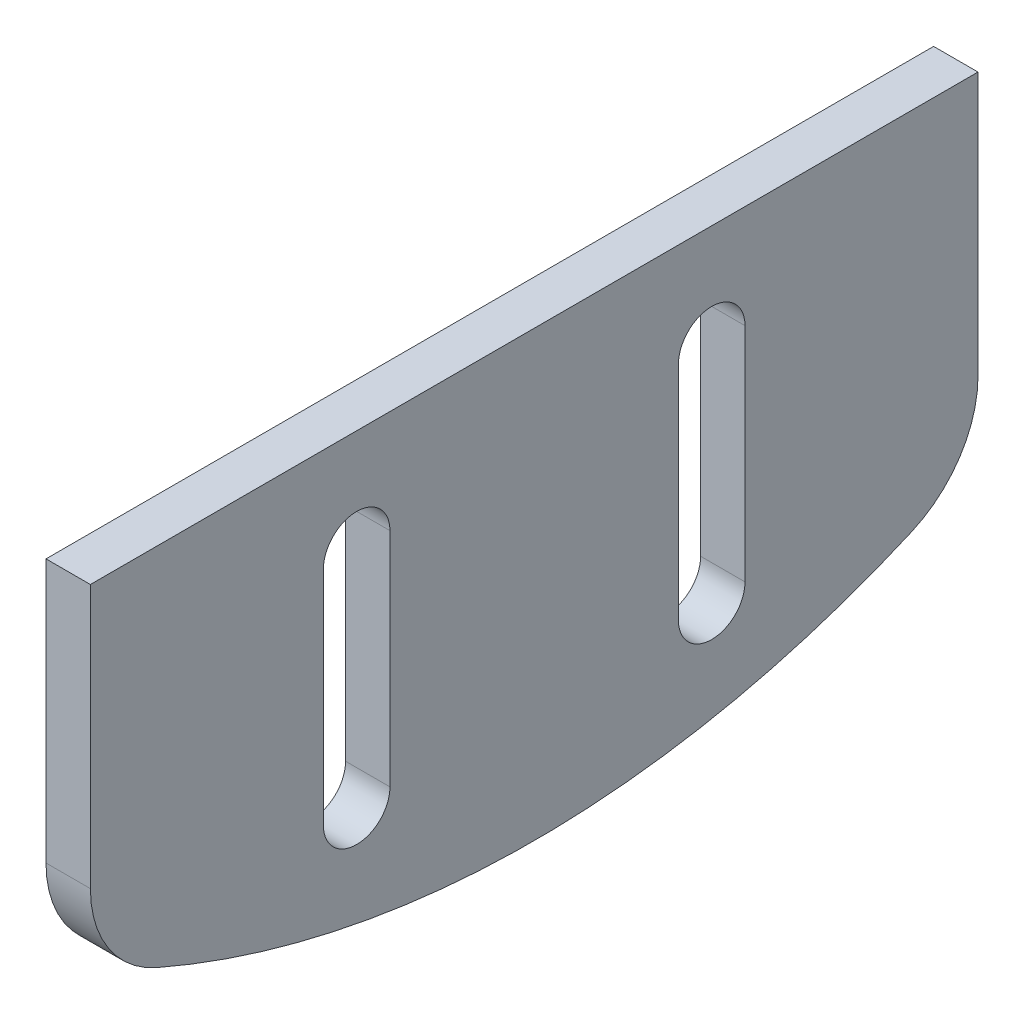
ISO-10303-21;
HEADER;
FILE_DESCRIPTION(('STEP AP214'),'2;1');
FILE_NAME('part.step','',(''),(''),'','','');
FILE_SCHEMA(('AUTOMOTIVE_DESIGN { 1 0 10303 214 1 1 1 1 }'));
ENDSEC;
DATA;
#1=APPLICATION_CONTEXT('core data for automotive mechanical design processes');
#2=APPLICATION_PROTOCOL_DEFINITION('international standard','automotive_design',2000,#1);
#3=PRODUCT_CONTEXT('',#1,'mechanical');
#4=PRODUCT('Part','Part','',(#3));
#5=PRODUCT_RELATED_PRODUCT_CATEGORY('part','',(#4));
#6=PRODUCT_DEFINITION_FORMATION('','',#4);
#7=PRODUCT_DEFINITION_CONTEXT('part definition',#1,'design');
#8=PRODUCT_DEFINITION('design','',#6,#7);
#9=PRODUCT_DEFINITION_SHAPE('','',#8);
#10=(LENGTH_UNIT() NAMED_UNIT(*) SI_UNIT(.MILLI.,.METRE.));
#11=(NAMED_UNIT(*) PLANE_ANGLE_UNIT() SI_UNIT($,.RADIAN.));
#12=(NAMED_UNIT(*) SI_UNIT($,.STERADIAN.) SOLID_ANGLE_UNIT());
#13=UNCERTAINTY_MEASURE_WITH_UNIT(LENGTH_MEASURE(1.E-05),#10,'distance_accuracy_value','');
#14=(GEOMETRIC_REPRESENTATION_CONTEXT(3) GLOBAL_UNCERTAINTY_ASSIGNED_CONTEXT((#13)) GLOBAL_UNIT_ASSIGNED_CONTEXT((#10,
#11,#12)) REPRESENTATION_CONTEXT('',''));
#15=CARTESIAN_POINT('',(0.,0.,0.));
#16=DIRECTION('',(0.,0.,1.));
#17=DIRECTION('',(1.,0.,0.));
#18=AXIS2_PLACEMENT_3D('',#15,#16,#17);
#19=CARTESIAN_POINT('',(2.,5.,-20.));
#20=DIRECTION('',(0.,0.,1.));
#21=DIRECTION('',(1.,0.,0.));
#22=AXIS2_PLACEMENT_3D('',#19,#20,#21);
#23=PLANE('',#22);
#24=DIRECTION('',(0.,1.,0.));
#25=VECTOR('',#24,1.);
#26=CARTESIAN_POINT('',(2.,5.,-20.));
#27=LINE('',#26,#25);
#28=CARTESIAN_POINT('',(2.,8.1306822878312,-20.));
#29=VERTEX_POINT('',#28);
#30=CARTESIAN_POINT('',(2.,20.,-20.));
#31=VERTEX_POINT('',#30);
#32=EDGE_CURVE('E219',#29,#31,#27,.T.);
#33=ORIENTED_EDGE('',*,*,#32,.F.);
#34=DIRECTION('',(-1.,0.,0.));
#35=VECTOR('',#34,1.);
#36=CARTESIAN_POINT('',(2.,8.1306822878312,-20.));
#37=LINE('',#36,#35);
#38=CARTESIAN_POINT('',(0.,8.1306822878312,-20.));
#39=VERTEX_POINT('',#38);
#40=EDGE_CURVE('E11',#29,#39,#37,.T.);
#41=ORIENTED_EDGE('',*,*,#40,.T.);
#42=DIRECTION('',(0.,1.,0.));
#43=VECTOR('',#42,1.);
#44=CARTESIAN_POINT('',(0.,5.,-20.));
#45=LINE('',#44,#43);
#46=CARTESIAN_POINT('',(0.,20.,-20.));
#47=VERTEX_POINT('',#46);
#48=EDGE_CURVE('E184',#39,#47,#45,.T.);
#49=ORIENTED_EDGE('',*,*,#48,.T.);
#50=DIRECTION('',(-1.,0.,0.));
#51=VECTOR('',#50,1.);
#52=CARTESIAN_POINT('',(2.,20.,-20.));
#53=LINE('',#52,#51);
#54=EDGE_CURVE('E238',#31,#47,#53,.T.);
#55=ORIENTED_EDGE('',*,*,#54,.F.);
#56=EDGE_LOOP('',(#33,#41,#49,#55));
#57=FACE_BOUND('',#56,.T.);
#58=ADVANCED_FACE('F39',(#57),#23,.F.);
#59=CARTESIAN_POINT('',(2.,20.,20.));
#60=DIRECTION('',(0.,-1.,0.));
#61=DIRECTION('',(0.,0.,-1.));
#62=AXIS2_PLACEMENT_3D('',#59,#60,#61);
#63=PLANE('',#62);
#64=DIRECTION('',(0.,0.,1.));
#65=VECTOR('',#64,1.);
#66=CARTESIAN_POINT('',(0.,20.,20.));
#67=LINE('',#66,#65);
#68=CARTESIAN_POINT('',(0.,20.,20.));
#69=VERTEX_POINT('',#68);
#70=EDGE_CURVE('E230',#47,#69,#67,.T.);
#71=ORIENTED_EDGE('',*,*,#70,.T.);
#72=DIRECTION('',(-1.,0.,0.));
#73=VECTOR('',#72,1.);
#74=CARTESIAN_POINT('',(2.,20.,20.));
#75=LINE('',#74,#73);
#76=CARTESIAN_POINT('',(2.,20.,20.));
#77=VERTEX_POINT('',#76);
#78=EDGE_CURVE('E228',#77,#69,#75,.T.);
#79=ORIENTED_EDGE('',*,*,#78,.F.);
#80=DIRECTION('',(0.,0.,1.));
#81=VECTOR('',#80,1.);
#82=CARTESIAN_POINT('',(2.,20.,20.));
#83=LINE('',#82,#81);
#84=EDGE_CURVE('E221',#31,#77,#83,.T.);
#85=ORIENTED_EDGE('',*,*,#84,.F.);
#86=ORIENTED_EDGE('',*,*,#54,.T.);
#87=EDGE_LOOP('',(#71,#79,#85,#86));
#88=FACE_BOUND('',#87,.T.);
#89=ADVANCED_FACE('F268',(#88),#63,.F.);
#90=CARTESIAN_POINT('',(2.,5.,20.));
#91=DIRECTION('',(0.,0.,-1.));
#92=DIRECTION('',(-1.,0.,0.));
#93=AXIS2_PLACEMENT_3D('',#90,#91,#92);
#94=PLANE('',#93);
#95=DIRECTION('',(0.,-1.,0.));
#96=VECTOR('',#95,1.);
#97=CARTESIAN_POINT('',(0.,5.,20.));
#98=LINE('',#97,#96);
#99=CARTESIAN_POINT('',(0.,8.1306822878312,20.));
#100=VERTEX_POINT('',#99);
#101=EDGE_CURVE('E232',#69,#100,#98,.T.);
#102=ORIENTED_EDGE('',*,*,#101,.T.);
#103=DIRECTION('',(-1.,0.,0.));
#104=VECTOR('',#103,1.);
#105=CARTESIAN_POINT('',(2.,8.1306822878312,20.));
#106=LINE('',#105,#104);
#107=CARTESIAN_POINT('',(2.,8.1306822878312,20.));
#108=VERTEX_POINT('',#107);
#109=EDGE_CURVE('E62',#100,#108,#106,.F.);
#110=ORIENTED_EDGE('',*,*,#109,.T.);
#111=DIRECTION('',(0.,-1.,0.));
#112=VECTOR('',#111,1.);
#113=CARTESIAN_POINT('',(2.,5.,20.));
#114=LINE('',#113,#112);
#115=EDGE_CURVE('E224',#77,#108,#114,.T.);
#116=ORIENTED_EDGE('',*,*,#115,.F.);
#117=ORIENTED_EDGE('',*,*,#78,.T.);
#118=EDGE_LOOP('',(#102,#110,#116,#117));
#119=FACE_BOUND('',#118,.T.);
#120=ADVANCED_FACE('F264',(#119),#94,.F.);
#121=CARTESIAN_POINT('',(2.,42.5,0.));
#122=DIRECTION('',(-1.,0.,0.));
#123=DIRECTION('',(0.,0.,1.));
#124=AXIS2_PLACEMENT_3D('',#121,#122,#123);
#125=CYLINDRICAL_SURFACE('',#124,42.5);
#126=CARTESIAN_POINT('',(2.,42.5,0.));
#127=DIRECTION('',(1.,0.,0.));
#128=DIRECTION('',(0.,0.,-1.));
#129=AXIS2_PLACEMENT_3D('',#126,#127,#128);
#130=CIRCLE('',#129,42.5);
#131=CARTESIAN_POINT('',(2.,3.54810659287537,17.));
#132=VERTEX_POINT('',#131);
#133=CARTESIAN_POINT('',(2.,3.54810659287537,-17.));
#134=VERTEX_POINT('',#133);
#135=EDGE_CURVE('E226',#132,#134,#130,.T.);
#136=ORIENTED_EDGE('',*,*,#135,.F.);
#137=DIRECTION('',(-1.,0.,0.));
#138=VECTOR('',#137,1.);
#139=CARTESIAN_POINT('',(2.,3.54810659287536,17.));
#140=LINE('',#139,#138);
#141=CARTESIAN_POINT('',(0.,3.54810659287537,17.));
#142=VERTEX_POINT('',#141);
#143=EDGE_CURVE('E243',#132,#142,#140,.T.);
#144=ORIENTED_EDGE('',*,*,#143,.T.);
#145=CARTESIAN_POINT('',(0.,42.5,0.));
#146=DIRECTION('',(1.,0.,0.));
#147=DIRECTION('',(0.,0.,-1.));
#148=AXIS2_PLACEMENT_3D('',#145,#146,#147);
#149=CIRCLE('',#148,42.5);
#150=CARTESIAN_POINT('',(0.,3.54810659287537,-17.));
#151=VERTEX_POINT('',#150);
#152=EDGE_CURVE('E222',#142,#151,#149,.T.);
#153=ORIENTED_EDGE('',*,*,#152,.T.);
#154=DIRECTION('',(-1.,0.,0.));
#155=VECTOR('',#154,1.);
#156=CARTESIAN_POINT('',(2.,3.54810659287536,-17.));
#157=LINE('',#156,#155);
#158=EDGE_CURVE('E241',#151,#134,#157,.F.);
#159=ORIENTED_EDGE('',*,*,#158,.T.);
#160=EDGE_LOOP('',(#136,#144,#153,#159));
#161=FACE_BOUND('',#160,.T.);
#162=ADVANCED_FACE('F257',(#161),#125,.T.);
#163=CARTESIAN_POINT('',(2.,42.5,0.));
#164=DIRECTION('',(1.,0.,0.));
#165=DIRECTION('',(0.,0.,-1.));
#166=AXIS2_PLACEMENT_3D('',#163,#164,#165);
#167=PLANE('',#166);
#168=CARTESIAN_POINT('',(2.,5.35164875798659,8.));
#169=DIRECTION('',(1.,0.,0.));
#170=DIRECTION('',(0.,0.,-1.));
#171=AXIS2_PLACEMENT_3D('',#168,#169,#170);
#172=CIRCLE('',#171,1.5);
#173=CARTESIAN_POINT('',(2.,5.35164875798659,9.5));
#174=VERTEX_POINT('',#173);
#175=CARTESIAN_POINT('',(2.,5.35164875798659,6.5));
#176=VERTEX_POINT('',#175);
#177=EDGE_CURVE('E150',#174,#176,#172,.T.);
#178=ORIENTED_EDGE('',*,*,#177,.F.);
#179=DIRECTION('',(0.,-1.,0.));
#180=VECTOR('',#179,1.);
#181=CARTESIAN_POINT('',(2.,5.35164875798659,9.5));
#182=LINE('',#181,#180);
#183=CARTESIAN_POINT('',(2.,15.3516487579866,9.5));
#184=VERTEX_POINT('',#183);
#185=EDGE_CURVE('E168',#184,#174,#182,.T.);
#186=ORIENTED_EDGE('',*,*,#185,.F.);
#187=CARTESIAN_POINT('',(2.,15.3516487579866,8.));
#188=DIRECTION('',(1.,0.,0.));
#189=DIRECTION('',(0.,0.,-1.));
#190=AXIS2_PLACEMENT_3D('',#187,#188,#189);
#191=CIRCLE('',#190,1.5);
#192=CARTESIAN_POINT('',(2.,15.3516487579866,6.5));
#193=VERTEX_POINT('',#192);
#194=EDGE_CURVE('E171',#193,#184,#191,.T.);
#195=ORIENTED_EDGE('',*,*,#194,.F.);
#196=DIRECTION('',(0.,1.,0.));
#197=VECTOR('',#196,1.);
#198=CARTESIAN_POINT('',(2.,5.35164875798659,6.5));
#199=LINE('',#198,#197);
#200=EDGE_CURVE('E177',#176,#193,#199,.T.);
#201=ORIENTED_EDGE('',*,*,#200,.F.);
#202=EDGE_LOOP('',(#178,#186,#195,#201));
#203=FACE_BOUND('',#202,.T.);
#204=CARTESIAN_POINT('',(2.,5.35164875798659,-8.));
#205=DIRECTION('',(1.,0.,0.));
#206=DIRECTION('',(0.,0.,1.));
#207=AXIS2_PLACEMENT_3D('',#204,#205,#206);
#208=CIRCLE('',#207,1.5);
#209=CARTESIAN_POINT('',(2.,5.35164875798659,-6.5));
#210=VERTEX_POINT('',#209);
#211=CARTESIAN_POINT('',(2.,5.35164875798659,-9.5));
#212=VERTEX_POINT('',#211);
#213=EDGE_CURVE('E178',#210,#212,#208,.T.);
#214=ORIENTED_EDGE('',*,*,#213,.F.);
#215=DIRECTION('',(0.,-1.,0.));
#216=VECTOR('',#215,1.);
#217=CARTESIAN_POINT('',(2.,5.35164875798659,-6.5));
#218=LINE('',#217,#216);
#219=CARTESIAN_POINT('',(2.,15.3516487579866,-6.5));
#220=VERTEX_POINT('',#219);
#221=EDGE_CURVE('E198',#220,#210,#218,.T.);
#222=ORIENTED_EDGE('',*,*,#221,.F.);
#223=CARTESIAN_POINT('',(2.,15.3516487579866,-8.));
#224=DIRECTION('',(1.,0.,0.));
#225=DIRECTION('',(0.,0.,1.));
#226=AXIS2_PLACEMENT_3D('',#223,#224,#225);
#227=CIRCLE('',#226,1.5);
#228=CARTESIAN_POINT('',(2.,15.3516487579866,-9.5));
#229=VERTEX_POINT('',#228);
#230=EDGE_CURVE('E201',#229,#220,#227,.T.);
#231=ORIENTED_EDGE('',*,*,#230,.F.);
#232=DIRECTION('',(0.,1.,0.));
#233=VECTOR('',#232,1.);
#234=CARTESIAN_POINT('',(2.,5.35164875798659,-9.5));
#235=LINE('',#234,#233);
#236=EDGE_CURVE('E205',#212,#229,#235,.T.);
#237=ORIENTED_EDGE('',*,*,#236,.F.);
#238=EDGE_LOOP('',(#214,#222,#231,#237));
#239=FACE_BOUND('',#238,.T.);
#240=ORIENTED_EDGE('',*,*,#115,.T.);
#241=CARTESIAN_POINT('',(2.,8.1306822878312,15.));
#242=DIRECTION('',(1.,0.,0.));
#243=DIRECTION('',(0.,0.,-1.));
#244=AXIS2_PLACEMENT_3D('',#241,#242,#243);
#245=CIRCLE('',#244,5.);
#246=EDGE_CURVE('E47',#108,#132,#245,.T.);
#247=ORIENTED_EDGE('',*,*,#246,.T.);
#248=ORIENTED_EDGE('',*,*,#135,.T.);
#249=CARTESIAN_POINT('',(2.,8.1306822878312,-15.));
#250=DIRECTION('',(1.,0.,0.));
#251=DIRECTION('',(0.,0.,-1.));
#252=AXIS2_PLACEMENT_3D('',#249,#250,#251);
#253=CIRCLE('',#252,5.);
#254=EDGE_CURVE('E54',#134,#29,#253,.T.);
#255=ORIENTED_EDGE('',*,*,#254,.T.);
#256=ORIENTED_EDGE('',*,*,#32,.T.);
#257=ORIENTED_EDGE('',*,*,#84,.T.);
#258=EDGE_LOOP('',(#240,#247,#248,#255,#256,#257));
#259=FACE_BOUND('',#258,.T.);
#260=ADVANCED_FACE('F253',(#203,#239,#259),#167,.T.);
#261=CARTESIAN_POINT('',(0.,42.5,0.));
#262=DIRECTION('',(1.,0.,0.));
#263=DIRECTION('',(0.,0.,-1.));
#264=AXIS2_PLACEMENT_3D('',#261,#262,#263);
#265=PLANE('',#264);
#266=DIRECTION('',(0.,-1.,0.));
#267=VECTOR('',#266,1.);
#268=CARTESIAN_POINT('',(0.,5.35164875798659,9.5));
#269=LINE('',#268,#267);
#270=CARTESIAN_POINT('',(0.,15.3516487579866,9.5));
#271=VERTEX_POINT('',#270);
#272=CARTESIAN_POINT('',(0.,5.35164875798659,9.5));
#273=VERTEX_POINT('',#272);
#274=EDGE_CURVE('E155',#271,#273,#269,.T.);
#275=ORIENTED_EDGE('',*,*,#274,.T.);
#276=CARTESIAN_POINT('',(0.,5.35164875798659,8.));
#277=DIRECTION('',(1.,0.,0.));
#278=DIRECTION('',(0.,0.,-1.));
#279=AXIS2_PLACEMENT_3D('',#276,#277,#278);
#280=CIRCLE('',#279,1.5);
#281=CARTESIAN_POINT('',(0.,5.35164875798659,6.5));
#282=VERTEX_POINT('',#281);
#283=EDGE_CURVE('E147',#273,#282,#280,.T.);
#284=ORIENTED_EDGE('',*,*,#283,.T.);
#285=DIRECTION('',(0.,1.,0.));
#286=VECTOR('',#285,1.);
#287=CARTESIAN_POINT('',(0.,5.35164875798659,6.5));
#288=LINE('',#287,#286);
#289=CARTESIAN_POINT('',(0.,15.3516487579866,6.5));
#290=VERTEX_POINT('',#289);
#291=EDGE_CURVE('E159',#282,#290,#288,.T.);
#292=ORIENTED_EDGE('',*,*,#291,.T.);
#293=CARTESIAN_POINT('',(0.,15.3516487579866,8.));
#294=DIRECTION('',(1.,0.,0.));
#295=DIRECTION('',(0.,0.,-1.));
#296=AXIS2_PLACEMENT_3D('',#293,#294,#295);
#297=CIRCLE('',#296,1.5);
#298=EDGE_CURVE('E163',#290,#271,#297,.T.);
#299=ORIENTED_EDGE('',*,*,#298,.T.);
#300=EDGE_LOOP('',(#275,#284,#292,#299));
#301=FACE_BOUND('',#300,.T.);
#302=DIRECTION('',(0.,-1.,0.));
#303=VECTOR('',#302,1.);
#304=CARTESIAN_POINT('',(0.,5.35164875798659,-6.5));
#305=LINE('',#304,#303);
#306=CARTESIAN_POINT('',(0.,15.3516487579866,-6.5));
#307=VERTEX_POINT('',#306);
#308=CARTESIAN_POINT('',(0.,5.35164875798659,-6.5));
#309=VERTEX_POINT('',#308);
#310=EDGE_CURVE('E191',#307,#309,#305,.T.);
#311=ORIENTED_EDGE('',*,*,#310,.T.);
#312=CARTESIAN_POINT('',(0.,5.35164875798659,-8.));
#313=DIRECTION('',(1.,0.,0.));
#314=DIRECTION('',(0.,0.,1.));
#315=AXIS2_PLACEMENT_3D('',#312,#313,#314);
#316=CIRCLE('',#315,1.5);
#317=CARTESIAN_POINT('',(0.,5.35164875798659,-9.5));
#318=VERTEX_POINT('',#317);
#319=EDGE_CURVE('E202',#309,#318,#316,.T.);
#320=ORIENTED_EDGE('',*,*,#319,.T.);
#321=DIRECTION('',(0.,1.,0.));
#322=VECTOR('',#321,1.);
#323=CARTESIAN_POINT('',(0.,5.35164875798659,-9.5));
#324=LINE('',#323,#322);
#325=CARTESIAN_POINT('',(0.,15.3516487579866,-9.5));
#326=VERTEX_POINT('',#325);
#327=EDGE_CURVE('E214',#318,#326,#324,.T.);
#328=ORIENTED_EDGE('',*,*,#327,.T.);
#329=CARTESIAN_POINT('',(0.,15.3516487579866,-8.));
#330=DIRECTION('',(1.,0.,0.));
#331=DIRECTION('',(0.,0.,1.));
#332=AXIS2_PLACEMENT_3D('',#329,#330,#331);
#333=CIRCLE('',#332,1.5);
#334=EDGE_CURVE('E211',#326,#307,#333,.T.);
#335=ORIENTED_EDGE('',*,*,#334,.T.);
#336=EDGE_LOOP('',(#311,#320,#328,#335));
#337=FACE_BOUND('',#336,.T.);
#338=ORIENTED_EDGE('',*,*,#152,.F.);
#339=CARTESIAN_POINT('',(0.,8.1306822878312,15.));
#340=DIRECTION('',(1.,0.,0.));
#341=DIRECTION('',(0.,0.,-1.));
#342=AXIS2_PLACEMENT_3D('',#339,#340,#341);
#343=CIRCLE('',#342,5.);
#344=EDGE_CURVE('E248',#142,#100,#343,.F.);
#345=ORIENTED_EDGE('',*,*,#344,.T.);
#346=ORIENTED_EDGE('',*,*,#101,.F.);
#347=ORIENTED_EDGE('',*,*,#70,.F.);
#348=ORIENTED_EDGE('',*,*,#48,.F.);
#349=CARTESIAN_POINT('',(0.,8.1306822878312,-15.));
#350=DIRECTION('',(1.,0.,0.));
#351=DIRECTION('',(0.,0.,-1.));
#352=AXIS2_PLACEMENT_3D('',#349,#350,#351);
#353=CIRCLE('',#352,5.);
#354=EDGE_CURVE('E246',#39,#151,#353,.F.);
#355=ORIENTED_EDGE('',*,*,#354,.T.);
#356=EDGE_LOOP('',(#338,#345,#346,#347,#348,#355));
#357=FACE_BOUND('',#356,.T.);
#358=ADVANCED_FACE('F165',(#301,#337,#357),#265,.F.);
#359=CARTESIAN_POINT('',(0.,5.35164875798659,-8.));
#360=DIRECTION('',(1.,0.,0.));
#361=DIRECTION('',(0.,0.,-1.));
#362=AXIS2_PLACEMENT_3D('',#359,#360,#361);
#363=CYLINDRICAL_SURFACE('',#362,1.5);
#364=ORIENTED_EDGE('',*,*,#213,.T.);
#365=DIRECTION('',(1.,0.,0.));
#366=VECTOR('',#365,1.);
#367=CARTESIAN_POINT('',(0.,5.35164875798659,-9.5));
#368=LINE('',#367,#366);
#369=EDGE_CURVE('E188',#318,#212,#368,.T.);
#370=ORIENTED_EDGE('',*,*,#369,.F.);
#371=ORIENTED_EDGE('',*,*,#319,.F.);
#372=DIRECTION('',(1.,0.,0.));
#373=VECTOR('',#372,1.);
#374=CARTESIAN_POINT('',(0.,5.35164875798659,-6.5));
#375=LINE('',#374,#373);
#376=EDGE_CURVE('E196',#309,#210,#375,.T.);
#377=ORIENTED_EDGE('',*,*,#376,.T.);
#378=EDGE_LOOP('',(#364,#370,#371,#377));
#379=FACE_BOUND('',#378,.T.);
#380=ADVANCED_FACE('F292',(#379),#363,.F.);
#381=CARTESIAN_POINT('',(0.,5.35164875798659,-6.5));
#382=DIRECTION('',(0.,0.,1.));
#383=DIRECTION('',(0.,-1.,0.));
#384=AXIS2_PLACEMENT_3D('',#381,#382,#383);
#385=PLANE('',#384);
#386=ORIENTED_EDGE('',*,*,#221,.T.);
#387=ORIENTED_EDGE('',*,*,#376,.F.);
#388=ORIENTED_EDGE('',*,*,#310,.F.);
#389=DIRECTION('',(1.,0.,0.));
#390=VECTOR('',#389,1.);
#391=CARTESIAN_POINT('',(0.,15.3516487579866,-6.5));
#392=LINE('',#391,#390);
#393=EDGE_CURVE('E194',#307,#220,#392,.T.);
#394=ORIENTED_EDGE('',*,*,#393,.T.);
#395=EDGE_LOOP('',(#386,#387,#388,#394));
#396=FACE_BOUND('',#395,.T.);
#397=ADVANCED_FACE('F296',(#396),#385,.F.);
#398=CARTESIAN_POINT('',(0.,15.3516487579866,-8.));
#399=DIRECTION('',(1.,0.,0.));
#400=DIRECTION('',(0.,0.,-1.));
#401=AXIS2_PLACEMENT_3D('',#398,#399,#400);
#402=CYLINDRICAL_SURFACE('',#401,1.5);
#403=ORIENTED_EDGE('',*,*,#230,.T.);
#404=ORIENTED_EDGE('',*,*,#393,.F.);
#405=ORIENTED_EDGE('',*,*,#334,.F.);
#406=DIRECTION('',(1.,0.,0.));
#407=VECTOR('',#406,1.);
#408=CARTESIAN_POINT('',(0.,15.3516487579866,-9.5));
#409=LINE('',#408,#407);
#410=EDGE_CURVE('E192',#326,#229,#409,.T.);
#411=ORIENTED_EDGE('',*,*,#410,.T.);
#412=EDGE_LOOP('',(#403,#404,#405,#411));
#413=FACE_BOUND('',#412,.T.);
#414=ADVANCED_FACE('F299',(#413),#402,.F.);
#415=CARTESIAN_POINT('',(0.,5.35164875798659,-9.5));
#416=DIRECTION('',(0.,0.,-1.));
#417=DIRECTION('',(0.,1.,0.));
#418=AXIS2_PLACEMENT_3D('',#415,#416,#417);
#419=PLANE('',#418);
#420=ORIENTED_EDGE('',*,*,#236,.T.);
#421=ORIENTED_EDGE('',*,*,#410,.F.);
#422=ORIENTED_EDGE('',*,*,#327,.F.);
#423=ORIENTED_EDGE('',*,*,#369,.T.);
#424=EDGE_LOOP('',(#420,#421,#422,#423));
#425=FACE_BOUND('',#424,.T.);
#426=ADVANCED_FACE('F303',(#425),#419,.F.);
#427=CARTESIAN_POINT('',(0.,5.35164875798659,8.));
#428=DIRECTION('',(1.,0.,0.));
#429=DIRECTION('',(0.,0.,-1.));
#430=AXIS2_PLACEMENT_3D('',#427,#428,#429);
#431=CYLINDRICAL_SURFACE('',#430,1.5);
#432=ORIENTED_EDGE('',*,*,#177,.T.);
#433=DIRECTION('',(1.,0.,0.));
#434=VECTOR('',#433,1.);
#435=CARTESIAN_POINT('',(0.,5.35164875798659,6.5));
#436=LINE('',#435,#434);
#437=EDGE_CURVE('E143',#282,#176,#436,.T.);
#438=ORIENTED_EDGE('',*,*,#437,.F.);
#439=ORIENTED_EDGE('',*,*,#283,.F.);
#440=DIRECTION('',(1.,0.,0.));
#441=VECTOR('',#440,1.);
#442=CARTESIAN_POINT('',(0.,5.35164875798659,9.5));
#443=LINE('',#442,#441);
#444=EDGE_CURVE('E182',#273,#174,#443,.T.);
#445=ORIENTED_EDGE('',*,*,#444,.T.);
#446=EDGE_LOOP('',(#432,#438,#439,#445));
#447=FACE_BOUND('',#446,.T.);
#448=ADVANCED_FACE('F145',(#447),#431,.F.);
#449=CARTESIAN_POINT('',(0.,5.35164875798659,9.5));
#450=DIRECTION('',(0.,0.,1.));
#451=DIRECTION('',(0.,-1.,0.));
#452=AXIS2_PLACEMENT_3D('',#449,#450,#451);
#453=PLANE('',#452);
#454=ORIENTED_EDGE('',*,*,#185,.T.);
#455=ORIENTED_EDGE('',*,*,#444,.F.);
#456=ORIENTED_EDGE('',*,*,#274,.F.);
#457=DIRECTION('',(1.,0.,0.));
#458=VECTOR('',#457,1.);
#459=CARTESIAN_POINT('',(0.,15.3516487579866,9.5));
#460=LINE('',#459,#458);
#461=EDGE_CURVE('E185',#271,#184,#460,.T.);
#462=ORIENTED_EDGE('',*,*,#461,.T.);
#463=EDGE_LOOP('',(#454,#455,#456,#462));
#464=FACE_BOUND('',#463,.T.);
#465=ADVANCED_FACE('F313',(#464),#453,.F.);
#466=CARTESIAN_POINT('',(0.,15.3516487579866,8.));
#467=DIRECTION('',(1.,0.,0.));
#468=DIRECTION('',(0.,0.,-1.));
#469=AXIS2_PLACEMENT_3D('',#466,#467,#468);
#470=CYLINDRICAL_SURFACE('',#469,1.5);
#471=ORIENTED_EDGE('',*,*,#194,.T.);
#472=ORIENTED_EDGE('',*,*,#461,.F.);
#473=ORIENTED_EDGE('',*,*,#298,.F.);
#474=DIRECTION('',(1.,0.,0.));
#475=VECTOR('',#474,1.);
#476=CARTESIAN_POINT('',(0.,15.3516487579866,6.5));
#477=LINE('',#476,#475);
#478=EDGE_CURVE('E154',#290,#193,#477,.T.);
#479=ORIENTED_EDGE('',*,*,#478,.T.);
#480=EDGE_LOOP('',(#471,#472,#473,#479));
#481=FACE_BOUND('',#480,.T.);
#482=ADVANCED_FACE('F315',(#481),#470,.F.);
#483=CARTESIAN_POINT('',(0.,5.35164875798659,6.5));
#484=DIRECTION('',(0.,0.,-1.));
#485=DIRECTION('',(0.,1.,0.));
#486=AXIS2_PLACEMENT_3D('',#483,#484,#485);
#487=PLANE('',#486);
#488=ORIENTED_EDGE('',*,*,#200,.T.);
#489=ORIENTED_EDGE('',*,*,#478,.F.);
#490=ORIENTED_EDGE('',*,*,#291,.F.);
#491=ORIENTED_EDGE('',*,*,#437,.T.);
#492=EDGE_LOOP('',(#488,#489,#490,#491));
#493=FACE_BOUND('',#492,.T.);
#494=ADVANCED_FACE('F160',(#493),#487,.F.);
#495=CARTESIAN_POINT('',(2.,8.1306822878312,15.));
#496=DIRECTION('',(-1.,0.,0.));
#497=DIRECTION('',(0.,0.,1.));
#498=AXIS2_PLACEMENT_3D('',#495,#496,#497);
#499=CYLINDRICAL_SURFACE('',#498,5.);
#500=ORIENTED_EDGE('',*,*,#246,.F.);
#501=ORIENTED_EDGE('',*,*,#109,.F.);
#502=ORIENTED_EDGE('',*,*,#344,.F.);
#503=ORIENTED_EDGE('',*,*,#143,.F.);
#504=EDGE_LOOP('',(#500,#501,#502,#503));
#505=FACE_BOUND('',#504,.T.);
#506=ADVANCED_FACE('F260',(#505),#499,.T.);
#507=CARTESIAN_POINT('',(2.,8.1306822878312,-15.));
#508=DIRECTION('',(-1.,0.,0.));
#509=DIRECTION('',(0.,0.,1.));
#510=AXIS2_PLACEMENT_3D('',#507,#508,#509);
#511=CYLINDRICAL_SURFACE('',#510,5.);
#512=ORIENTED_EDGE('',*,*,#254,.F.);
#513=ORIENTED_EDGE('',*,*,#158,.F.);
#514=ORIENTED_EDGE('',*,*,#354,.F.);
#515=ORIENTED_EDGE('',*,*,#40,.F.);
#516=EDGE_LOOP('',(#512,#513,#514,#515));
#517=FACE_BOUND('',#516,.T.);
#518=ADVANCED_FACE('F41',(#517),#511,.T.);
#519=CLOSED_SHELL('',(#58,#89,#120,#162,#260,#358,#380,#397,#414,#426,#448,#465,#482,#494,#506,#518));
#520=MANIFOLD_SOLID_BREP('B2',#519);
#521=ADVANCED_BREP_SHAPE_REPRESENTATION('',(#18,#520),#14);
#522=SHAPE_DEFINITION_REPRESENTATION(#9,#521);
ENDSEC;
END-ISO-10303-21;
